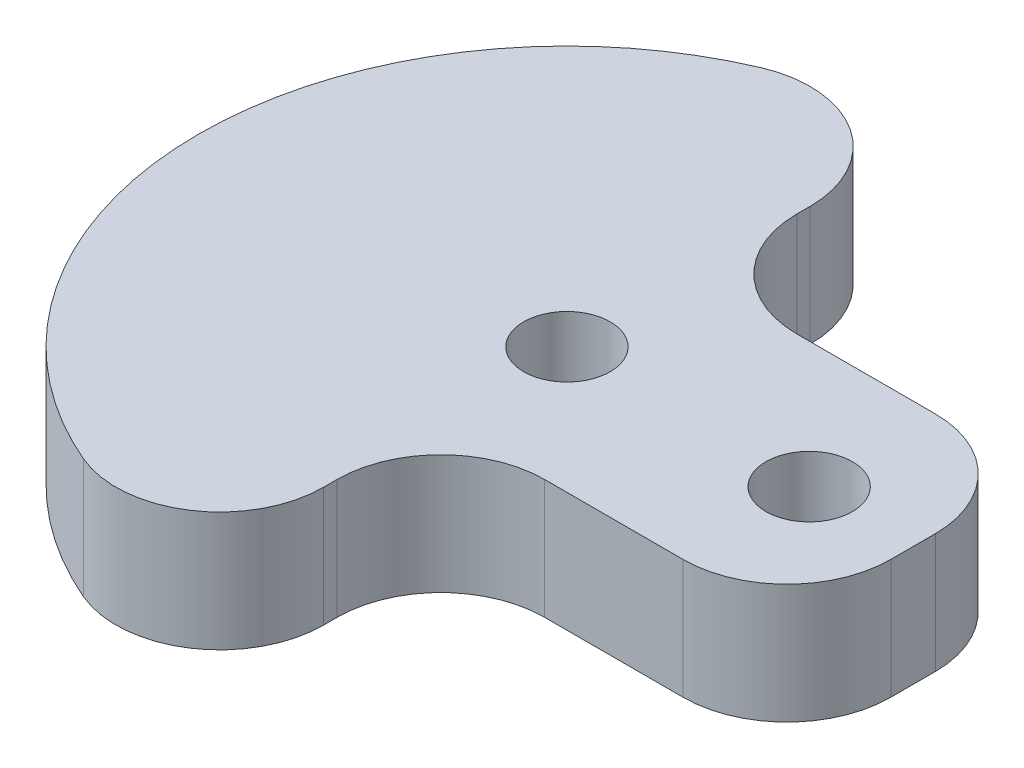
from build123d import *

# Parameters (mm, degrees)
SKETCH1_R           = 3.175
BOSS_EXTRUDE2_DEPTH = 8.763


with BuildPart() as part:
    # Sketch1 → Boss-Extrude2 (new body)
    with BuildSketch(Plane(origin=(0, 0, 0), x_dir=(1, 0, 0), z_dir=(0, 1, 0))):
        with BuildLine():
            Line((0, 17.854820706), (0, 16.872857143))
            ThreePointArc((0, 16.872857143), (2.231846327, 11.48470347), (7.62, 9.252857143))
            Line((7.62, 9.252857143), (17.78, 9.252857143))
            ThreePointArc((17.78, 9.252857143), (23.168153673, 7.021010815), (25.4, 1.632857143))
            Line((25.4, 1.632857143), (25.4, -1.632857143))
            ThreePointArc((25.4, -1.632857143), (23.168153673, -7.021010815), (17.78, -9.252857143))
            Line((17.78, -9.252857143), (7.62, -9.252857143))
            ThreePointArc((7.62, -9.252857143), (2.231846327, -11.48470347), (0, -16.872857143))
            Line((0, -16.872857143), (0, -17.854820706))
            ThreePointArc((0, -17.854820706), (-3.420430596, -24.213123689), (-10.611028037, -24.863255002))
            ThreePointArc((-10.611028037, -24.863255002), (-27.032857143, 0), (-10.611028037, 24.863255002))
            ThreePointArc((-10.611028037, 24.863255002), (-3.420430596, 24.213123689), (0, 17.854820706))
        make_face()
        with Locations(Location((0, 0, 0), (0, 0, 270))):
            Circle(SKETCH1_R, mode=Mode.SUBTRACT)
        with Locations(Location((17.78, 0, 0), (0, 0, 270))):
            Circle(SKETCH1_R, mode=Mode.SUBTRACT)
    extrude(amount=BOSS_EXTRUDE2_DEPTH)


solid = part.part
